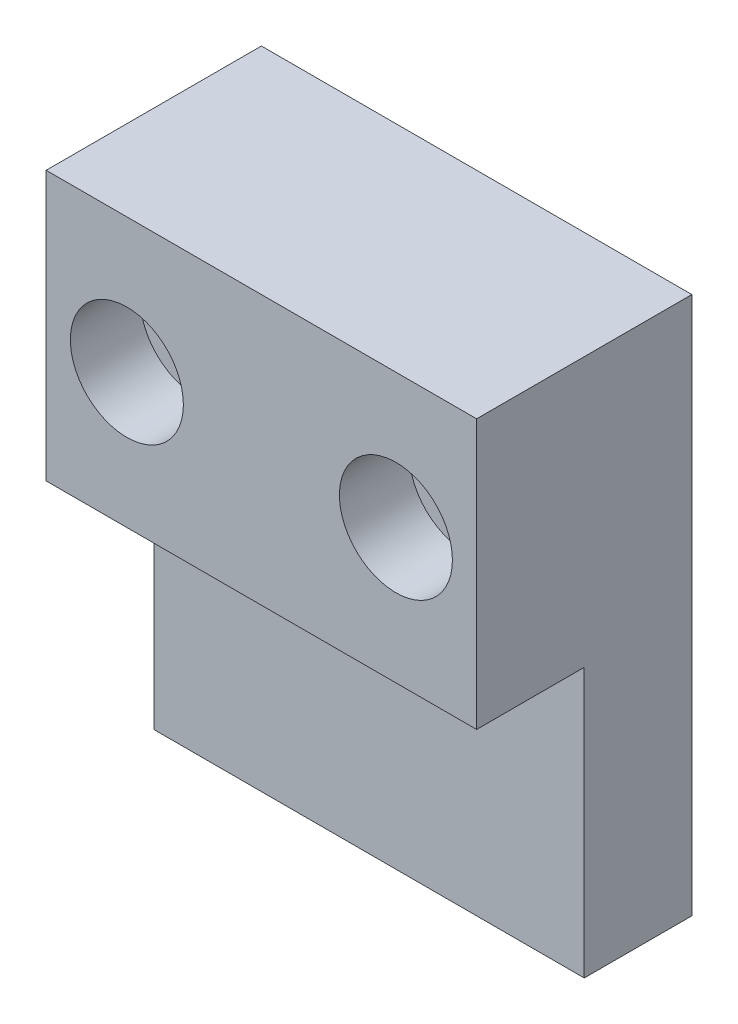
from build123d import *

# Parameters (mm, degrees)
ESQUISSE1_W             = 40
ESQUISSE1_H             = 50
EXTRUSION1_DEPTH        = 20
ESQUISSE3_W             = 40
ESQUISSE3_H             = 25
ENL_V_MAT_EXTRU_1_DEPTH = 10
PER_AGE1_D              = 6.5
PER_AGE1_DEPTH          = 25
PER_AGE1_CBORE_D        = 10.5
PER_AGE1_CBORE_DEPTH    = 6.5
PER_AGE1_TIP            = 1.952797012
ESQUISSE7_R             = 6
ENL_V_MAT_EXTRU_2_DEPTH = 5
ESQUISSE8_R             = 6
ENL_V_MAT_EXTRU_3_DEPTH = 5


with BuildPart() as part:
    # Esquisse1 → Extrusion1 (new body)
    with BuildSketch(Plane.XY):
        with Locations((20, 25)):
            Rectangle(ESQUISSE1_W, ESQUISSE1_H)
    extrude(amount=EXTRUSION1_DEPTH)

    # Esquisse3 → Enl_v. mat.-Extru.1 (cut)
    with BuildSketch(Plane.XY.offset(20)):
        with Locations((20, 12.5)):
            Rectangle(ESQUISSE3_W, ESQUISSE3_H)
    extrude(amount=-ENL_V_MAT_EXTRU_1_DEPTH, mode=Mode.SUBTRACT)

    # Per_age1
    with Locations(Plane.XY.offset(20)):
        with Locations((7.5, 37.5), (32.5, 37.5)):
            CounterBoreHole(PER_AGE1_D / 2, PER_AGE1_CBORE_D / 2, PER_AGE1_CBORE_DEPTH, depth=PER_AGE1_DEPTH)
            with Locations((0, 0, -(PER_AGE1_DEPTH + PER_AGE1_TIP / 2))):  # 118° drill point
                Cone(0, PER_AGE1_D / 2, PER_AGE1_TIP, mode=Mode.SUBTRACT)

    # Esquisse7 → Enl_v. mat.-Extru.2 (cut)
    with BuildSketch(Plane(origin=(0, 0, 0), x_dir=(-1, 0, 0), z_dir=(0, 0, -1))):
        with Locations((-32.5, 37.5)):
            Circle(ESQUISSE7_R)
    extrude(amount=-ENL_V_MAT_EXTRU_2_DEPTH, mode=Mode.SUBTRACT)

    # Esquisse8 → Enl_v. mat.-Extru.3 (cut)
    with BuildSketch(Plane(origin=(0, 0, 0), x_dir=(-1, 0, 0), z_dir=(0, 0, -1))):
        with Locations((-7.5, 37.5)):
            Circle(ESQUISSE8_R)
    extrude(amount=-ENL_V_MAT_EXTRU_3_DEPTH, mode=Mode.SUBTRACT)


solid = part.part
